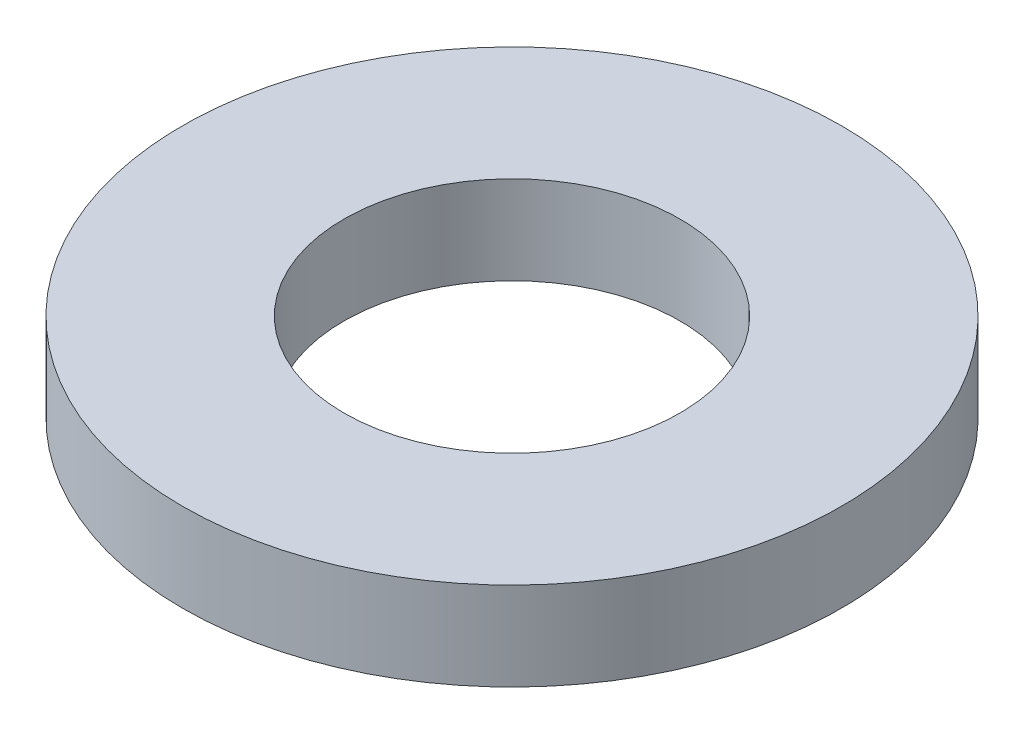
ISO-10303-21;
HEADER;
FILE_DESCRIPTION(('STEP AP214'),'2;1');
FILE_NAME('part.step','',(''),(''),'','','');
FILE_SCHEMA(('AUTOMOTIVE_DESIGN { 1 0 10303 214 1 1 1 1 }'));
ENDSEC;
DATA;
#1=APPLICATION_CONTEXT('core data for automotive mechanical design processes');
#2=APPLICATION_PROTOCOL_DEFINITION('international standard','automotive_design',2000,#1);
#3=PRODUCT_CONTEXT('',#1,'mechanical');
#4=PRODUCT('Part','Part','',(#3));
#5=PRODUCT_RELATED_PRODUCT_CATEGORY('part','',(#4));
#6=PRODUCT_DEFINITION_FORMATION('','',#4);
#7=PRODUCT_DEFINITION_CONTEXT('part definition',#1,'design');
#8=PRODUCT_DEFINITION('design','',#6,#7);
#9=PRODUCT_DEFINITION_SHAPE('','',#8);
#10=(LENGTH_UNIT() NAMED_UNIT(*) SI_UNIT(.MILLI.,.METRE.));
#11=(NAMED_UNIT(*) PLANE_ANGLE_UNIT() SI_UNIT($,.RADIAN.));
#12=(NAMED_UNIT(*) SI_UNIT($,.STERADIAN.) SOLID_ANGLE_UNIT());
#13=UNCERTAINTY_MEASURE_WITH_UNIT(LENGTH_MEASURE(1.E-05),#10,'distance_accuracy_value','');
#14=(GEOMETRIC_REPRESENTATION_CONTEXT(3) GLOBAL_UNCERTAINTY_ASSIGNED_CONTEXT((#13)) GLOBAL_UNIT_ASSIGNED_CONTEXT((#10,
#11,#12)) REPRESENTATION_CONTEXT('',''));
#15=CARTESIAN_POINT('',(0.,0.,0.));
#16=DIRECTION('',(0.,0.,1.));
#17=DIRECTION('',(1.,0.,0.));
#18=AXIS2_PLACEMENT_3D('',#15,#16,#17);
#19=CARTESIAN_POINT('',(0.,1.7018,0.));
#20=DIRECTION('',(0.,-1.,0.));
#21=DIRECTION('',(0.,0.,-1.));
#22=AXIS2_PLACEMENT_3D('',#19,#20,#21);
#23=CYLINDRICAL_SURFACE('',#22,6.35);
#24=CARTESIAN_POINT('',(0.,1.7018,0.));
#25=DIRECTION('',(0.,1.,0.));
#26=DIRECTION('',(0.,0.,1.));
#27=AXIS2_PLACEMENT_3D('',#24,#25,#26);
#28=CIRCLE('',#27,6.35);
#29=CARTESIAN_POINT('',(0.,1.7018,6.35));
#30=VERTEX_POINT('',#29);
#31=EDGE_CURVE('E10',#30,#30,#28,.T.);
#32=ORIENTED_EDGE('',*,*,#31,.F.);
#33=EDGE_LOOP('',(#32));
#34=FACE_BOUND('',#33,.T.);
#35=CARTESIAN_POINT('',(0.,0.,0.));
#36=DIRECTION('',(0.,1.,0.));
#37=DIRECTION('',(0.,0.,1.));
#38=AXIS2_PLACEMENT_3D('',#35,#36,#37);
#39=CIRCLE('',#38,6.35);
#40=CARTESIAN_POINT('',(0.,0.,6.35));
#41=VERTEX_POINT('',#40);
#42=EDGE_CURVE('E33',#41,#41,#39,.T.);
#43=ORIENTED_EDGE('',*,*,#42,.T.);
#44=EDGE_LOOP('',(#43));
#45=FACE_BOUND('',#44,.T.);
#46=ADVANCED_FACE('F30',(#34,#45),#23,.T.);
#47=CARTESIAN_POINT('',(0.,1.7018,0.));
#48=DIRECTION('',(0.,1.,0.));
#49=DIRECTION('',(0.,0.,1.));
#50=AXIS2_PLACEMENT_3D('',#47,#48,#49);
#51=PLANE('',#50);
#52=CARTESIAN_POINT('',(0.,1.7018,0.));
#53=DIRECTION('',(0.,1.,0.));
#54=DIRECTION('',(0.,0.,1.));
#55=AXIS2_PLACEMENT_3D('',#52,#53,#54);
#56=CIRCLE('',#55,3.2385);
#57=CARTESIAN_POINT('',(0.,1.7018,3.2385));
#58=VERTEX_POINT('',#57);
#59=EDGE_CURVE('E42',#58,#58,#56,.T.);
#60=ORIENTED_EDGE('',*,*,#59,.F.);
#61=EDGE_LOOP('',(#60));
#62=FACE_BOUND('',#61,.T.);
#63=ORIENTED_EDGE('',*,*,#31,.T.);
#64=EDGE_LOOP('',(#63));
#65=FACE_BOUND('',#64,.T.);
#66=ADVANCED_FACE('F57',(#62,#65),#51,.T.);
#67=CARTESIAN_POINT('',(0.,0.,0.));
#68=DIRECTION('',(0.,1.,0.));
#69=DIRECTION('',(0.,0.,1.));
#70=AXIS2_PLACEMENT_3D('',#67,#68,#69);
#71=PLANE('',#70);
#72=CARTESIAN_POINT('',(0.,0.,0.));
#73=DIRECTION('',(0.,1.,0.));
#74=DIRECTION('',(0.,0.,1.));
#75=AXIS2_PLACEMENT_3D('',#72,#73,#74);
#76=CIRCLE('',#75,3.2385);
#77=CARTESIAN_POINT('',(0.,0.,3.2385));
#78=VERTEX_POINT('',#77);
#79=EDGE_CURVE('E40',#78,#78,#76,.T.);
#80=ORIENTED_EDGE('',*,*,#79,.T.);
#81=EDGE_LOOP('',(#80));
#82=FACE_BOUND('',#81,.T.);
#83=ORIENTED_EDGE('',*,*,#42,.F.);
#84=EDGE_LOOP('',(#83));
#85=FACE_BOUND('',#84,.T.);
#86=ADVANCED_FACE('F48',(#82,#85),#71,.F.);
#87=CARTESIAN_POINT('',(0.,0.,0.));
#88=DIRECTION('',(0.,1.,0.));
#89=DIRECTION('',(0.,0.,1.));
#90=AXIS2_PLACEMENT_3D('',#87,#88,#89);
#91=CYLINDRICAL_SURFACE('',#90,3.2385);
#92=ORIENTED_EDGE('',*,*,#79,.F.);
#93=EDGE_LOOP('',(#92));
#94=FACE_BOUND('',#93,.T.);
#95=ORIENTED_EDGE('',*,*,#59,.T.);
#96=EDGE_LOOP('',(#95));
#97=FACE_BOUND('',#96,.T.);
#98=ADVANCED_FACE('F51',(#94,#97),#91,.F.);
#99=CLOSED_SHELL('',(#46,#66,#86,#98));
#100=MANIFOLD_SOLID_BREP('B2',#99);
#101=ADVANCED_BREP_SHAPE_REPRESENTATION('',(#18,#100),#14);
#102=SHAPE_DEFINITION_REPRESENTATION(#9,#101);
ENDSEC;
END-ISO-10303-21;
